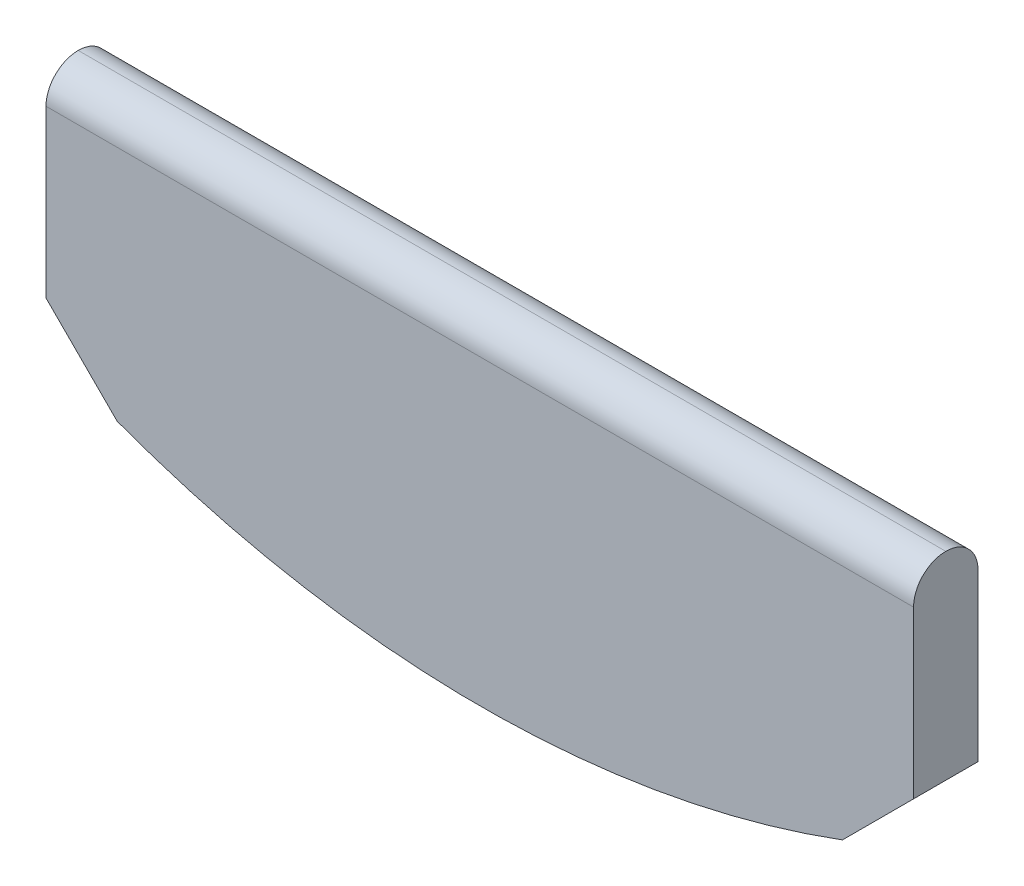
ISO-10303-21;
HEADER;
FILE_DESCRIPTION(('STEP AP214'),'2;1');
FILE_NAME('part.step','',(''),(''),'','','');
FILE_SCHEMA(('AUTOMOTIVE_DESIGN { 1 0 10303 214 1 1 1 1 }'));
ENDSEC;
DATA;
#1=APPLICATION_CONTEXT('core data for automotive mechanical design processes');
#2=APPLICATION_PROTOCOL_DEFINITION('international standard','automotive_design',2000,#1);
#3=PRODUCT_CONTEXT('',#1,'mechanical');
#4=PRODUCT('Part','Part','',(#3));
#5=PRODUCT_RELATED_PRODUCT_CATEGORY('part','',(#4));
#6=PRODUCT_DEFINITION_FORMATION('','',#4);
#7=PRODUCT_DEFINITION_CONTEXT('part definition',#1,'design');
#8=PRODUCT_DEFINITION('design','',#6,#7);
#9=PRODUCT_DEFINITION_SHAPE('','',#8);
#10=(LENGTH_UNIT() NAMED_UNIT(*) SI_UNIT(.MILLI.,.METRE.));
#11=(NAMED_UNIT(*) PLANE_ANGLE_UNIT() SI_UNIT($,.RADIAN.));
#12=(NAMED_UNIT(*) SI_UNIT($,.STERADIAN.) SOLID_ANGLE_UNIT());
#13=UNCERTAINTY_MEASURE_WITH_UNIT(LENGTH_MEASURE(1.E-05),#10,'distance_accuracy_value','');
#14=(GEOMETRIC_REPRESENTATION_CONTEXT(3) GLOBAL_UNCERTAINTY_ASSIGNED_CONTEXT((#13)) GLOBAL_UNIT_ASSIGNED_CONTEXT((#10,
#11,#12)) REPRESENTATION_CONTEXT('',''));
#15=CARTESIAN_POINT('',(0.,0.,0.));
#16=DIRECTION('',(0.,0.,1.));
#17=DIRECTION('',(1.,0.,0.));
#18=AXIS2_PLACEMENT_3D('',#15,#16,#17);
#19=CARTESIAN_POINT('',(1.04083408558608E-13,42.,1.29999999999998));
#20=DIRECTION('',(0.,0.,-1.));
#21=DIRECTION('',(-1.,0.,0.));
#22=AXIS2_PLACEMENT_3D('',#19,#20,#21);
#23=CYLINDRICAL_SURFACE('',#22,42.);
#24=CARTESIAN_POINT('',(0.,42.,-1.3));
#25=DIRECTION('',(0.,0.,1.));
#26=DIRECTION('',(1.,0.,0.));
#27=AXIS2_PLACEMENT_3D('',#24,#25,#26);
#28=CIRCLE('',#27,42.);
#29=CARTESIAN_POINT('',(-14.630683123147,2.630683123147,-1.3));
#30=VERTEX_POINT('',#29);
#31=CARTESIAN_POINT('',(14.6306831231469,2.63068312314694,-1.30000000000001));
#32=VERTEX_POINT('',#31);
#33=EDGE_CURVE('E418',#30,#32,#28,.T.);
#34=ORIENTED_EDGE('',*,*,#33,.T.);
#35=DIRECTION('',(0.,0.,-1.));
#36=VECTOR('',#35,1.);
#37=CARTESIAN_POINT('',(14.6306831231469,2.63068312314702,1.3));
#38=LINE('',#37,#36);
#39=CARTESIAN_POINT('',(14.6306831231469,2.63068312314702,1.3));
#40=VERTEX_POINT('',#39);
#41=EDGE_CURVE('E426',#40,#32,#38,.T.);
#42=ORIENTED_EDGE('',*,*,#41,.F.);
#43=CARTESIAN_POINT('',(1.04083408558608E-13,42.,1.29999999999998));
#44=DIRECTION('',(0.,0.,1.));
#45=DIRECTION('',(1.,0.,0.));
#46=AXIS2_PLACEMENT_3D('',#43,#44,#45);
#47=CIRCLE('',#46,42.);
#48=CARTESIAN_POINT('',(-14.630683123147,2.63068312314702,1.3));
#49=VERTEX_POINT('',#48);
#50=EDGE_CURVE('E448',#49,#40,#47,.T.);
#51=ORIENTED_EDGE('',*,*,#50,.F.);
#52=DIRECTION('',(0.,0.,-1.));
#53=VECTOR('',#52,1.);
#54=CARTESIAN_POINT('',(-14.630683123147,2.63068312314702,1.3));
#55=LINE('',#54,#53);
#56=EDGE_CURVE('E437',#49,#30,#55,.T.);
#57=ORIENTED_EDGE('',*,*,#56,.T.);
#58=EDGE_LOOP('',(#34,#42,#51,#57));
#59=FACE_BOUND('',#58,.T.);
#60=ADVANCED_FACE('F357',(#59),#23,.T.);
#61=CARTESIAN_POINT('',(17.5,5.49999999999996,1.3));
#62=DIRECTION('',(-0.707106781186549,0.707106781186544,0.));
#63=DIRECTION('',(-0.707106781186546,-0.70710678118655,0.));
#64=AXIS2_PLACEMENT_3D('',#61,#62,#63);
#65=PLANE('',#64);
#66=DIRECTION('',(0.707106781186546,0.70710678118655,0.));
#67=VECTOR('',#66,1.);
#68=CARTESIAN_POINT('',(17.5,5.49999999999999,-1.3));
#69=LINE('',#68,#67);
#70=CARTESIAN_POINT('',(17.5,5.49999999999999,-1.3));
#71=VERTEX_POINT('',#70);
#72=EDGE_CURVE('E412',#32,#71,#69,.T.);
#73=ORIENTED_EDGE('',*,*,#72,.T.);
#74=DIRECTION('',(0.,0.,-1.));
#75=VECTOR('',#74,1.);
#76=CARTESIAN_POINT('',(17.5,5.49999999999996,1.3));
#77=LINE('',#76,#75);
#78=CARTESIAN_POINT('',(17.5,5.49999999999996,1.3));
#79=VERTEX_POINT('',#78);
#80=EDGE_CURVE('E433',#79,#71,#77,.T.);
#81=ORIENTED_EDGE('',*,*,#80,.F.);
#82=DIRECTION('',(0.707106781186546,0.70710678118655,0.));
#83=VECTOR('',#82,1.);
#84=CARTESIAN_POINT('',(17.5,5.49999999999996,1.3));
#85=LINE('',#84,#83);
#86=EDGE_CURVE('E428',#40,#79,#85,.T.);
#87=ORIENTED_EDGE('',*,*,#86,.F.);
#88=ORIENTED_EDGE('',*,*,#41,.T.);
#89=EDGE_LOOP('',(#73,#81,#87,#88));
#90=FACE_BOUND('',#89,.T.);
#91=ADVANCED_FACE('F427',(#90),#65,.F.);
#92=CARTESIAN_POINT('',(17.5,13.4999999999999,1.29999999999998));
#93=DIRECTION('',(-1.,0.,0.));
#94=DIRECTION('',(0.,0.,1.));
#95=AXIS2_PLACEMENT_3D('',#92,#93,#94);
#96=PLANE('',#95);
#97=DIRECTION('',(0.,1.,0.));
#98=VECTOR('',#97,1.);
#99=CARTESIAN_POINT('',(17.5,13.4999999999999,-1.30000000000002));
#100=LINE('',#99,#98);
#101=CARTESIAN_POINT('',(17.5,12.2,-1.30000000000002));
#102=VERTEX_POINT('',#101);
#103=EDGE_CURVE('E420',#71,#102,#100,.T.);
#104=ORIENTED_EDGE('',*,*,#103,.T.);
#105=CARTESIAN_POINT('',(17.5,12.2,0.));
#106=DIRECTION('',(-1.,0.,0.));
#107=DIRECTION('',(0.,0.,1.));
#108=AXIS2_PLACEMENT_3D('',#105,#106,#107);
#109=CIRCLE('',#108,1.3);
#110=CARTESIAN_POINT('',(17.5,13.4999999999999,0.));
#111=VERTEX_POINT('',#110);
#112=EDGE_CURVE('E364',#102,#111,#109,.F.);
#113=ORIENTED_EDGE('',*,*,#112,.T.);
#114=CARTESIAN_POINT('',(17.5,12.2,0.));
#115=DIRECTION('',(-1.,0.,0.));
#116=DIRECTION('',(0.,0.,1.));
#117=AXIS2_PLACEMENT_3D('',#114,#115,#116);
#118=CIRCLE('',#117,1.3);
#119=CARTESIAN_POINT('',(17.5,12.2,1.29999999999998));
#120=VERTEX_POINT('',#119);
#121=EDGE_CURVE('E371',#111,#120,#118,.F.);
#122=ORIENTED_EDGE('',*,*,#121,.T.);
#123=DIRECTION('',(0.,1.,0.));
#124=VECTOR('',#123,1.);
#125=CARTESIAN_POINT('',(17.5,13.4999999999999,1.29999999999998));
#126=LINE('',#125,#124);
#127=EDGE_CURVE('E451',#79,#120,#126,.T.);
#128=ORIENTED_EDGE('',*,*,#127,.F.);
#129=ORIENTED_EDGE('',*,*,#80,.T.);
#130=EDGE_LOOP('',(#104,#113,#122,#128,#129));
#131=FACE_BOUND('',#130,.T.);
#132=ADVANCED_FACE('F470',(#131),#96,.F.);
#133=CARTESIAN_POINT('',(-17.5,13.5,1.3));
#134=DIRECTION('',(1.,0.,0.));
#135=DIRECTION('',(0.,0.,-1.));
#136=AXIS2_PLACEMENT_3D('',#133,#134,#135);
#137=PLANE('',#136);
#138=CARTESIAN_POINT('',(-17.5,12.2,0.));
#139=DIRECTION('',(1.,0.,0.));
#140=DIRECTION('',(0.,0.,-1.));
#141=AXIS2_PLACEMENT_3D('',#138,#139,#140);
#142=CIRCLE('',#141,1.3);
#143=CARTESIAN_POINT('',(-17.5,12.2,1.3));
#144=VERTEX_POINT('',#143);
#145=CARTESIAN_POINT('',(-17.5,13.5,0.));
#146=VERTEX_POINT('',#145);
#147=EDGE_CURVE('E432',#144,#146,#142,.F.);
#148=ORIENTED_EDGE('',*,*,#147,.T.);
#149=CARTESIAN_POINT('',(-17.5,12.2,0.));
#150=DIRECTION('',(1.,0.,0.));
#151=DIRECTION('',(0.,0.,-1.));
#152=AXIS2_PLACEMENT_3D('',#149,#150,#151);
#153=CIRCLE('',#152,1.3);
#154=CARTESIAN_POINT('',(-17.5,12.2,-1.30000000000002));
#155=VERTEX_POINT('',#154);
#156=EDGE_CURVE('E463',#146,#155,#153,.F.);
#157=ORIENTED_EDGE('',*,*,#156,.T.);
#158=DIRECTION('',(0.,-1.,0.));
#159=VECTOR('',#158,1.);
#160=CARTESIAN_POINT('',(-17.5,13.5,-1.30000000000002));
#161=LINE('',#160,#159);
#162=CARTESIAN_POINT('',(-17.5,5.49999999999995,-1.3));
#163=VERTEX_POINT('',#162);
#164=EDGE_CURVE('E444',#155,#163,#161,.T.);
#165=ORIENTED_EDGE('',*,*,#164,.T.);
#166=DIRECTION('',(0.,0.,-1.));
#167=VECTOR('',#166,1.);
#168=CARTESIAN_POINT('',(-17.5,5.49999999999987,1.29999999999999));
#169=LINE('',#168,#167);
#170=CARTESIAN_POINT('',(-17.5,5.49999999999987,1.29999999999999));
#171=VERTEX_POINT('',#170);
#172=EDGE_CURVE('E458',#171,#163,#169,.T.);
#173=ORIENTED_EDGE('',*,*,#172,.F.);
#174=DIRECTION('',(0.,-1.,0.));
#175=VECTOR('',#174,1.);
#176=CARTESIAN_POINT('',(-17.5,13.5,1.3));
#177=LINE('',#176,#175);
#178=EDGE_CURVE('E453',#144,#171,#177,.T.);
#179=ORIENTED_EDGE('',*,*,#178,.F.);
#180=EDGE_LOOP('',(#148,#157,#165,#173,#179));
#181=FACE_BOUND('',#180,.T.);
#182=ADVANCED_FACE('F480',(#181),#137,.F.);
#183=CARTESIAN_POINT('',(-17.5,5.49999999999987,1.29999999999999));
#184=DIRECTION('',(0.707106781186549,0.707106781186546,0.));
#185=DIRECTION('',(-0.707106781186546,0.707106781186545,0.));
#186=AXIS2_PLACEMENT_3D('',#183,#184,#185);
#187=PLANE('',#186);
#188=DIRECTION('',(0.707106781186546,-0.707106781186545,0.));
#189=VECTOR('',#188,1.);
#190=CARTESIAN_POINT('',(-17.5,5.49999999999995,-1.3));
#191=LINE('',#190,#189);
#192=EDGE_CURVE('E446',#163,#30,#191,.T.);
#193=ORIENTED_EDGE('',*,*,#192,.T.);
#194=ORIENTED_EDGE('',*,*,#56,.F.);
#195=DIRECTION('',(0.707106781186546,-0.707106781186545,0.));
#196=VECTOR('',#195,1.);
#197=CARTESIAN_POINT('',(-17.5,5.49999999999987,1.29999999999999));
#198=LINE('',#197,#196);
#199=EDGE_CURVE('E455',#171,#49,#198,.T.);
#200=ORIENTED_EDGE('',*,*,#199,.F.);
#201=ORIENTED_EDGE('',*,*,#172,.T.);
#202=EDGE_LOOP('',(#193,#194,#200,#201));
#203=FACE_BOUND('',#202,.T.);
#204=ADVANCED_FACE('F484',(#203),#187,.F.);
#205=CARTESIAN_POINT('',(1.04083408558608E-13,42.,1.29999999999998));
#206=DIRECTION('',(0.,0.,1.));
#207=DIRECTION('',(1.,0.,0.));
#208=AXIS2_PLACEMENT_3D('',#205,#206,#207);
#209=PLANE('',#208);
#210=ORIENTED_EDGE('',*,*,#127,.T.);
#211=DIRECTION('',(-1.,0.,0.));
#212=VECTOR('',#211,1.);
#213=CARTESIAN_POINT('',(-17.5,12.2,1.29999999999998));
#214=LINE('',#213,#212);
#215=EDGE_CURVE('E11',#120,#144,#214,.T.);
#216=ORIENTED_EDGE('',*,*,#215,.T.);
#217=ORIENTED_EDGE('',*,*,#178,.T.);
#218=ORIENTED_EDGE('',*,*,#199,.T.);
#219=ORIENTED_EDGE('',*,*,#50,.T.);
#220=ORIENTED_EDGE('',*,*,#86,.T.);
#221=EDGE_LOOP('',(#210,#216,#217,#218,#219,#220));
#222=FACE_BOUND('',#221,.T.);
#223=ADVANCED_FACE('F473',(#222),#209,.T.);
#224=CARTESIAN_POINT('',(0.,42.,-1.3));
#225=DIRECTION('',(0.,0.,1.));
#226=DIRECTION('',(1.,0.,0.));
#227=AXIS2_PLACEMENT_3D('',#224,#225,#226);
#228=PLANE('',#227);
#229=ORIENTED_EDGE('',*,*,#164,.F.);
#230=DIRECTION('',(-1.,0.,0.));
#231=VECTOR('',#230,1.);
#232=CARTESIAN_POINT('',(0.,12.2,-1.3));
#233=LINE('',#232,#231);
#234=EDGE_CURVE('E465',#155,#102,#233,.F.);
#235=ORIENTED_EDGE('',*,*,#234,.T.);
#236=ORIENTED_EDGE('',*,*,#103,.F.);
#237=ORIENTED_EDGE('',*,*,#72,.F.);
#238=ORIENTED_EDGE('',*,*,#33,.F.);
#239=ORIENTED_EDGE('',*,*,#192,.F.);
#240=EDGE_LOOP('',(#229,#235,#236,#237,#238,#239));
#241=FACE_BOUND('',#240,.T.);
#242=ADVANCED_FACE('F415',(#241),#228,.F.);
#243=CARTESIAN_POINT('',(1.01905013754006E-13,12.2,0.));
#244=DIRECTION('',(1.,0.,0.));
#245=DIRECTION('',(0.,0.,-1.));
#246=AXIS2_PLACEMENT_3D('',#243,#244,#245);
#247=CYLINDRICAL_SURFACE('',#246,1.3);
#248=ORIENTED_EDGE('',*,*,#215,.F.);
#249=ORIENTED_EDGE('',*,*,#121,.F.);
#250=DIRECTION('',(-1.,0.,0.));
#251=VECTOR('',#250,1.);
#252=CARTESIAN_POINT('',(17.5,13.5,0.));
#253=LINE('',#252,#251);
#254=EDGE_CURVE('E438',#146,#111,#253,.F.);
#255=ORIENTED_EDGE('',*,*,#254,.F.);
#256=ORIENTED_EDGE('',*,*,#147,.F.);
#257=EDGE_LOOP('',(#248,#249,#255,#256));
#258=FACE_BOUND('',#257,.T.);
#259=ADVANCED_FACE('F477',(#258),#247,.T.);
#260=CARTESIAN_POINT('',(-17.5,12.2,0.));
#261=DIRECTION('',(-1.,0.,0.));
#262=DIRECTION('',(0.,0.,1.));
#263=AXIS2_PLACEMENT_3D('',#260,#261,#262);
#264=CYLINDRICAL_SURFACE('',#263,1.3);
#265=ORIENTED_EDGE('',*,*,#112,.F.);
#266=ORIENTED_EDGE('',*,*,#234,.F.);
#267=ORIENTED_EDGE('',*,*,#156,.F.);
#268=ORIENTED_EDGE('',*,*,#254,.T.);
#269=EDGE_LOOP('',(#265,#266,#267,#268));
#270=FACE_BOUND('',#269,.T.);
#271=ADVANCED_FACE('F523',(#270),#264,.T.);
#272=CLOSED_SHELL('',(#60,#91,#132,#182,#204,#223,#242,#259,#271));
#273=MANIFOLD_SOLID_BREP('B2',#272);
#274=ADVANCED_BREP_SHAPE_REPRESENTATION('',(#18,#273),#14);
#275=SHAPE_DEFINITION_REPRESENTATION(#9,#274);
ENDSEC;
END-ISO-10303-21;
